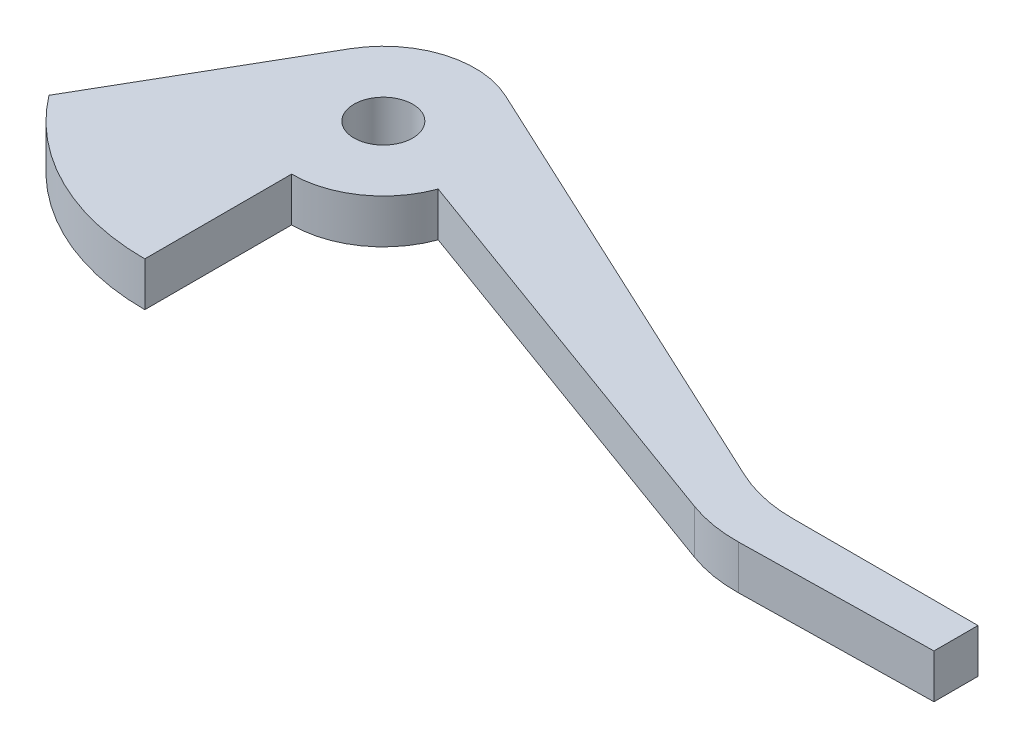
from build123d import *

# Parameters (mm, degrees)
ESQUISSE1_R        = 2
BOSS_EXTRU_1_DEPTH = 3
CONG_1_R           = 10


with BuildPart() as part:
    # Esquisse1 → Boss.-Extru.1 (new body)
    with BuildSketch(Plane(origin=(0, 11.230124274, 0), x_dir=(1, 0, 0), z_dir=(0, 1, 0))):
        with BuildLine():
            Line((3.821782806, -64.112448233), (3.821782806, -74.112448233))
            ThreePointArc((3.821782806, -74.112448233), (-3.380649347, -72.429104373), (-9.090875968, -67.72782929))
            Line((-9.090875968, -67.72782929), (-1.590875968, -54.737448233))
            ThreePointArc((-1.590875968, -54.737448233), (1.942371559, -51.901717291), (6.463146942, -52.198024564))
            Line((6.463146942, -52.198024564), (38.983358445, -67.362448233))
            Line((38.983358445, -67.362448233), (53.821782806, -67.362448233))
            Line((53.821782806, -67.362448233), (53.821782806, -70.362448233))
            Line((53.821782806, -70.362448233), (38.887658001, -70.625383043))
            Line((38.887658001, -70.625383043), (9.694861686, -60.000074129))
            ThreePointArc((9.694861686, -60.000074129), (7.406635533, -62.98214851), (3.821782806, -64.112448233))
        make_face()
        with Locations(Location((3.821782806, -57.862448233, 0), (0, 0, 270))):
            Circle(ESQUISSE1_R, mode=Mode.SUBTRACT)
    extrude(amount=BOSS_EXTRU_1_DEPTH)

    # Cong_1
    cong_1_edges = [part.edges().sort_by_distance(p)[0] for p in [
        (38.983358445, 12.730124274, 67.362448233),
        (38.887658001, 12.730124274, 70.625383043),
    ]]
    fillet(cong_1_edges, radius=CONG_1_R)


solid = part.part
